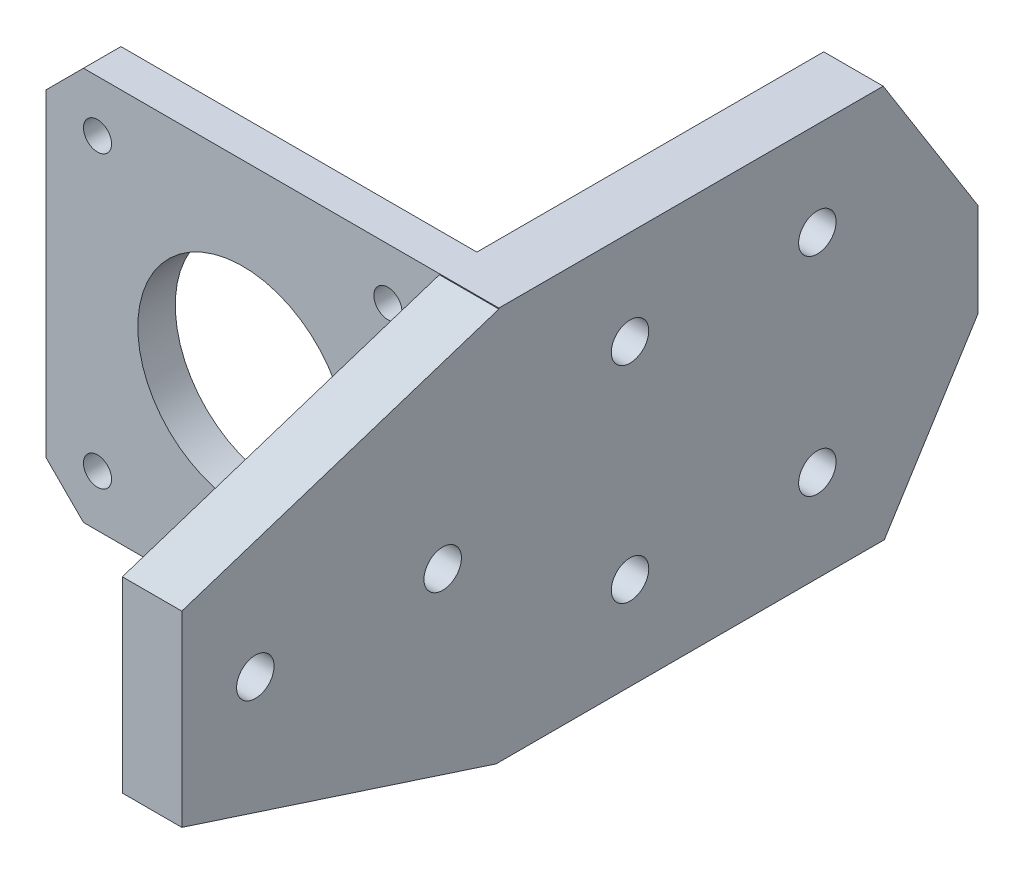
from build123d import *

# Parameters (mm, degrees)
SKETCH1_R           = 1.5
SKETCH1_R_2         = 11.2
BOSS_EXTRUDE1_DEPTH = 4
SKETCH4_W           = 6.35
SKETCH4_H           = 42
BOSS_EXTRUDE2_DEPTH = 85
SKETCH5_R           = 2
SKETCH5_R_2         = 2.000000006
CUT_EXTRUDE1_DEPTH  = 85
SKETCH6_R           = 2
SKETCH6_R_2         = 4.8
SKETCH6_R_3         = 3.8
CUT_EXTRUDE2_DEPTH  = 2.5


with BuildPart() as part:
    # Sketch1 → Boss-Extrude1 (new body)
    with BuildSketch(Plane.XY):
        Polygon((-38, 42), (-42, 38), (-42, 4), (-38, 0), (0, 0), (0, 42), align=None)
        with Locations((-36.5, 36.5)):
            Circle(SKETCH1_R, mode=Mode.SUBTRACT)
        with Locations((-5.5, 36.5)):
            Circle(SKETCH1_R, mode=Mode.SUBTRACT)
        with Locations((-5.5, 5.5)):
            Circle(SKETCH1_R, mode=Mode.SUBTRACT)
        with Locations((-36.5, 5.5)):
            Circle(SKETCH1_R, mode=Mode.SUBTRACT)
        with Locations((-21, 21)):
            Circle(SKETCH1_R_2, mode=Mode.SUBTRACT)
    extrude(amount=BOSS_EXTRUDE1_DEPTH)

    # Sketch4 → Boss-Extrude2 (add)
    with BuildSketch(Plane(origin=(0, 0, -47.15), x_dir=(-1, 0, 0), z_dir=(0, 0, -1))):
        with Locations((-3.175, 21)):
            Rectangle(SKETCH4_W, SKETCH4_H)
    extrude(amount=-BOSS_EXTRUDE2_DEPTH)

    # Sketch5 → Cut-Extrude1 (cut)
    with BuildSketch(Plane.ZY):
        Polygon((37.85, 0), (37.85, 10.905670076), (4.290278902, 0), align=None)
        Polygon((4, 41.905670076), (37.85, 30.905670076), (37.85, 42), (4, 42), align=None)
        Polygon((-47.15, 0), (-37.15, 0), (-47.15, 15.905670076), align=None)
        Polygon((-47.15, 25.905670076), (-37.031388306, 42), (-47.15, 42), align=None)
        with Locations((10, 20.905670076)):
            Circle(SKETCH5_R)
        with Locations((-10, 31.905670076)):
            Circle(SKETCH5_R_2)
        with Locations((-30, 32)):
            Circle(SKETCH5_R)
        with Locations((30, 20.905670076)):
            Circle(SKETCH5_R)
        with Locations((-30, 9.811340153)):
            Circle(SKETCH5_R)
        with Locations((-10, 9.905670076)):
            Circle(SKETCH5_R_2)
    extrude(amount=-CUT_EXTRUDE1_DEPTH, mode=Mode.SUBTRACT)

    # Sketch6 → Cut-Extrude2 (cut)
    # profile 1 of 8: a face of its own
    with BuildSketch(Plane.ZY):
        with Locations((30, 20.905670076)):
            Circle(SKETCH6_R)
    # profile 2 of 8: a face of its own
    with BuildSketch(Plane.ZY):
        with Locations((10, 20.905670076)):
            Circle(SKETCH6_R_2)
        with Locations((10, 20.905670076)):
            Circle(SKETCH6_R_3, mode=Mode.SUBTRACT)
    # profile 3 of 8: a face of its own
    with BuildSketch(Plane.ZY):
        with Locations((10, 20.905670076)):
            Circle(SKETCH6_R_3)
    # profile 4 of 8: a face of its own
    with BuildSketch(Plane.ZY):
        with Locations((-10, 9.905670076)):
            Circle(SKETCH6_R_2)
        with Locations((-10, 9.905670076)):
            Circle(SKETCH6_R, mode=Mode.SUBTRACT)
    # profile 5 of 8: a face of its own
    with BuildSketch(Plane.ZY):
        with Locations((-30, 9.905670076)):
            Circle(SKETCH6_R_2)
        with Locations((-30, 9.905670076)):
            Circle(SKETCH6_R, mode=Mode.SUBTRACT)
    # profile 6 of 8: a face of its own
    with BuildSketch(Plane.ZY):
        with Locations((-30, 31.905670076)):
            Circle(SKETCH6_R_2)
        with Locations((-30, 31.905670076)):
            Circle(SKETCH6_R, mode=Mode.SUBTRACT)
    # profile 7 of 8: a face of its own
    with BuildSketch(Plane.ZY):
        with Locations((-10, 31.905670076)):
            Circle(SKETCH6_R_2)
        with Locations((-10, 31.905670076)):
            Circle(SKETCH6_R, mode=Mode.SUBTRACT)
    # profile 8 of 8: a face of its own
    with BuildSketch(Plane.ZY):
        with Locations((30, 20.905670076)):
            Circle(SKETCH6_R_2)
    extrude(amount=-CUT_EXTRUDE2_DEPTH, mode=Mode.SUBTRACT)


solid = part.part
